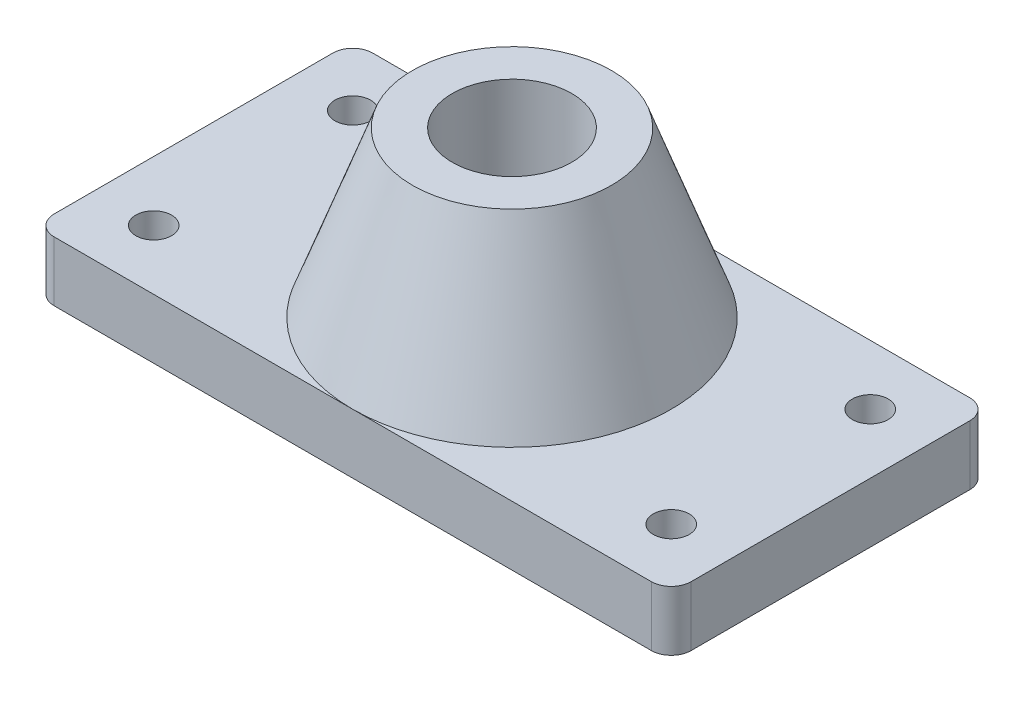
from build123d import *

# Parameters (mm, degrees)
AUFSATZ_LINEAR_AUSTRAGEN1_DEPTH                      = 15
STIRNSENKUNG_F_R_M8_ZYLINDERSCHRAUBE_MIT_D           = 9
STIRNSENKUNG_F_R_M8_ZYLINDERSCHRAUBE_MIT_CBORE_D     = 15
STIRNSENKUNG_F_R_M8_ZYLINDERSCHRAUBE_MIT_CBORE_DEPTH = 8.6
SPIEGELN2_COPY_1_D                                   = 9
SPIEGELN2_COPY_1_CBORE_D                             = 15
SPIEGELN2_COPY_1_CBORE_DEPTH                         = 8.6
VERRUNDUNG1_R                                        = 5
SKIZZE4_R                                            = 15
SCHNITT_LINEAR_AUSTRAGEN1_DEPTH                      = 170.995418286


with BuildPart() as part:
    # Skizze1 → Aufsatz-Linear austragen1 (new body)
    with BuildSketch(Plane(origin=(0, 0, 0), x_dir=(1, 0, 0), z_dir=(0, 1, 0))):
        Polygon((0, 0), (0, -40), (-160, -40), (-160, 40), (0, 40), align=None)
    extrude(amount=AUFSATZ_LINEAR_AUSTRAGEN1_DEPTH)

    # Skizze2 → Rotation1 (revolve)
    with BuildSketch(Plane.XY, mode=Mode.PRIVATE) as rotation1_sk:
        Polygon((-95, 56.212161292), (-95, 15), (-120, 15), (-105, 56.212161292), align=None)
    revolve(rotation1_sk.sketch.rotate(Axis((-80, 0, 0), (0, 1, 0)), 270), axis=Axis((-80, 0, 0), (0, 1, 0)))

    # Stirnsenkung f_r M8 Zylinderschraube mit (through all)
    with Locations(Plane(origin=(-145, 0, 25), x_dir=(0, 0, -1), z_dir=(0, -1, 0))):
        with Locations((0, 0)):
            stirnsenkung_f_r_m8_zylinderschraube_mit = CounterBoreHole(STIRNSENKUNG_F_R_M8_ZYLINDERSCHRAUBE_MIT_D / 2, STIRNSENKUNG_F_R_M8_ZYLINDERSCHRAUBE_MIT_CBORE_D / 2, STIRNSENKUNG_F_R_M8_ZYLINDERSCHRAUBE_MIT_CBORE_DEPTH)

    # Spiegeln1: Stirnsenkung f_r M8 Zylinderschraube mit across plane
    add(stirnsenkung_f_r_m8_zylinderschraube_mit.mirror(Plane(origin=(-80, 0, 0), x_dir=(0, 0, 1), z_dir=(1, 0, 0))), mode=Mode.SUBTRACT)

    # Spiegeln2: Stirnsenkung f_r M8 Zylinderschraube mit across plane
    add(stirnsenkung_f_r_m8_zylinderschraube_mit.mirror(Plane.XY), mode=Mode.SUBTRACT)

    # Spiegeln2 copy 1 (through all)
    with Locations(Plane(origin=(-15, 0, -25), x_dir=(0, 0, 1), z_dir=(0, -1, 0))):
        with Locations((0, 0)):
            CounterBoreHole(SPIEGELN2_COPY_1_D / 2, SPIEGELN2_COPY_1_CBORE_D / 2, SPIEGELN2_COPY_1_CBORE_DEPTH)

    # Verrundung1
    verrundung1_edges = [part.edges().sort_by_distance(p)[0] for p in [
        (0, 7.5, 40),
        (-160, 7.5, 40),
        (-160, 7.5, -40),
        (0, 7.5, -40),
    ]]
    fillet(verrundung1_edges, radius=VERRUNDUNG1_R)

    # Skizze4 → Schnitt-Linear austragen1 (cut, through all)
    with BuildSketch(Plane(origin=(0, 15, 0), x_dir=(1, 0, 0), z_dir=(0, 1, 0))):
        with Locations(Location((-80, 0, 0), (0, 0, 90))):
            Circle(SKIZZE4_R)
    extrude(amount=-SCHNITT_LINEAR_AUSTRAGEN1_DEPTH, mode=Mode.SUBTRACT)


solid = part.part
